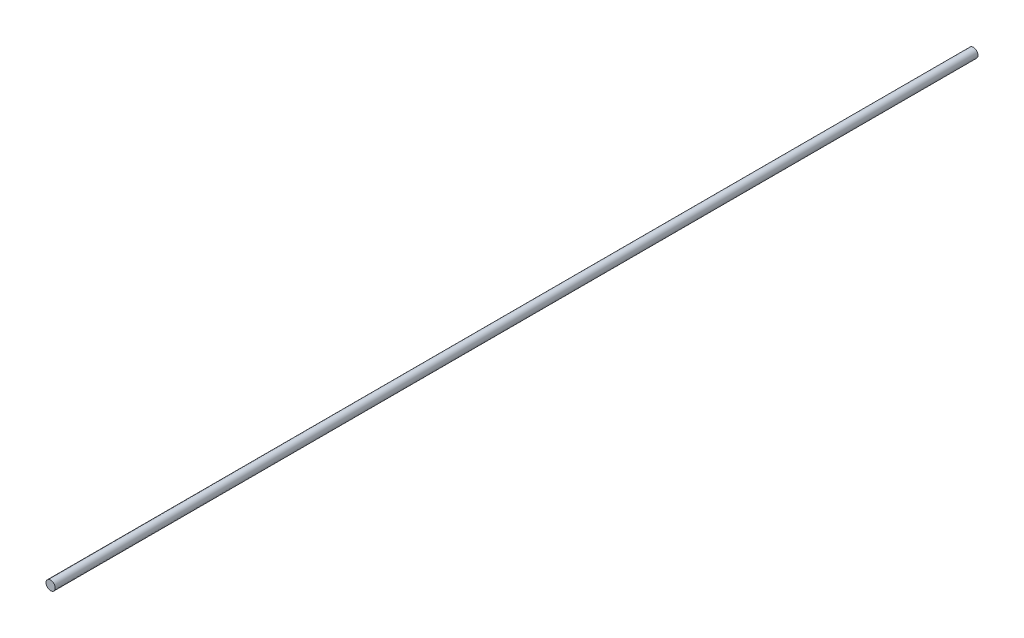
from build123d import *

# Parameters (mm, degrees)
ESQUISSE1_R      = 1.5
EXTRUSION1_DEPTH = 300


with BuildPart() as part:
    # Esquisse1 → Extrusion1 (new body)
    with BuildSketch(Plane.XY):
        Circle(ESQUISSE1_R)
    extrude(amount=EXTRUSION1_DEPTH)


solid = part.part
